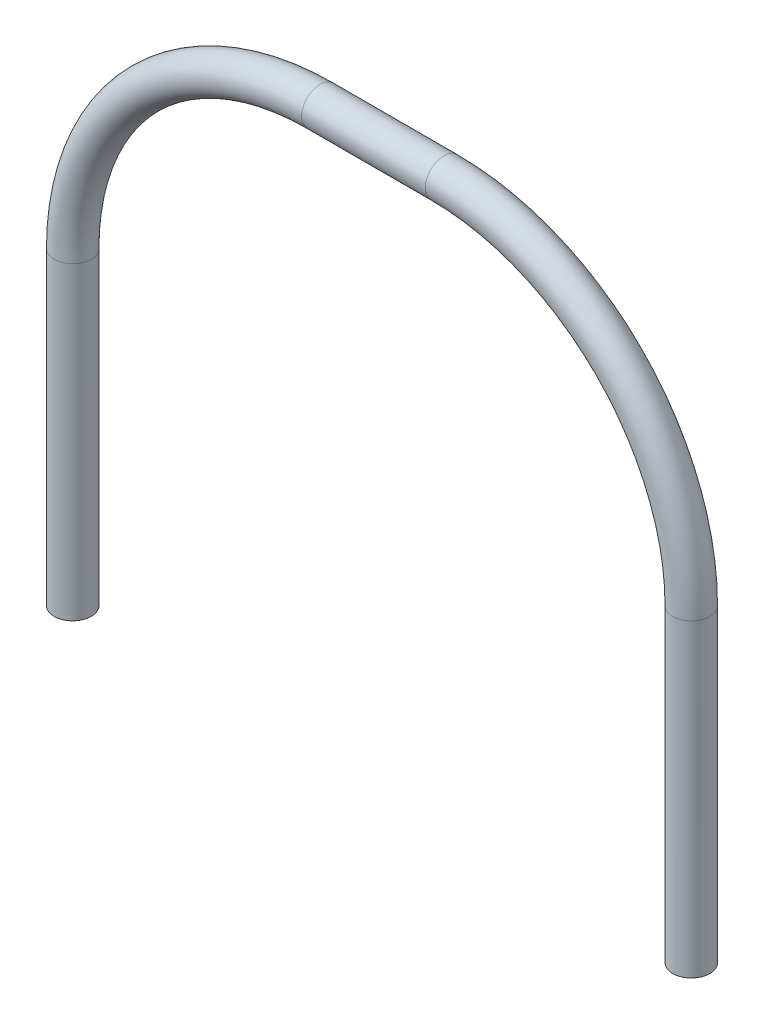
ISO-10303-21;
HEADER;
FILE_DESCRIPTION(('STEP AP214'),'2;1');
FILE_NAME('part.step','',(''),(''),'','','');
FILE_SCHEMA(('AUTOMOTIVE_DESIGN { 1 0 10303 214 1 1 1 1 }'));
ENDSEC;
DATA;
#1=APPLICATION_CONTEXT('core data for automotive mechanical design processes');
#2=APPLICATION_PROTOCOL_DEFINITION('international standard','automotive_design',2000,#1);
#3=PRODUCT_CONTEXT('',#1,'mechanical');
#4=PRODUCT('Part','Part','',(#3));
#5=PRODUCT_RELATED_PRODUCT_CATEGORY('part','',(#4));
#6=PRODUCT_DEFINITION_FORMATION('','',#4);
#7=PRODUCT_DEFINITION_CONTEXT('part definition',#1,'design');
#8=PRODUCT_DEFINITION('design','',#6,#7);
#9=PRODUCT_DEFINITION_SHAPE('','',#8);
#10=(LENGTH_UNIT() NAMED_UNIT(*) SI_UNIT(.MILLI.,.METRE.));
#11=(NAMED_UNIT(*) PLANE_ANGLE_UNIT() SI_UNIT($,.RADIAN.));
#12=(NAMED_UNIT(*) SI_UNIT($,.STERADIAN.) SOLID_ANGLE_UNIT());
#13=UNCERTAINTY_MEASURE_WITH_UNIT(LENGTH_MEASURE(1.E-05),#10,'distance_accuracy_value','');
#14=(GEOMETRIC_REPRESENTATION_CONTEXT(3) GLOBAL_UNCERTAINTY_ASSIGNED_CONTEXT((#13)) GLOBAL_UNIT_ASSIGNED_CONTEXT((#10,
#11,#12)) REPRESENTATION_CONTEXT('',''));
#15=CARTESIAN_POINT('',(0.,0.,0.));
#16=DIRECTION('',(0.,0.,1.));
#17=DIRECTION('',(1.,0.,0.));
#18=AXIS2_PLACEMENT_3D('',#15,#16,#17);
#19=CARTESIAN_POINT('',(5.,2.49999999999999,0.));
#20=DIRECTION('',(0.,-1.,0.));
#21=DIRECTION('',(0.,0.,-1.));
#22=AXIS2_PLACEMENT_3D('',#19,#20,#21);
#23=CYLINDRICAL_SURFACE('',#22,0.149999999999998);
#24=CARTESIAN_POINT('',(5.,2.49999999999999,0.));
#25=DIRECTION('',(0.,-1.,0.));
#26=DIRECTION('',(0.,0.,1.));
#27=AXIS2_PLACEMENT_3D('',#24,#25,#26);
#28=CIRCLE('',#27,0.149999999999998);
#29=CARTESIAN_POINT('',(5.15,2.49999999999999,0.));
#30=VERTEX_POINT('',#29);
#31=EDGE_CURVE('E30',#30,#30,#28,.T.);
#32=ORIENTED_EDGE('',*,*,#31,.T.);
#33=EDGE_LOOP('',(#32));
#34=FACE_BOUND('',#33,.T.);
#35=CARTESIAN_POINT('',(5.,0.,0.));
#36=DIRECTION('',(0.,-1.,0.));
#37=DIRECTION('',(0.,0.,1.));
#38=AXIS2_PLACEMENT_3D('',#35,#36,#37);
#39=CIRCLE('',#38,0.149999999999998);
#40=CARTESIAN_POINT('',(5.,0.,0.149999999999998));
#41=VERTEX_POINT('',#40);
#42=EDGE_CURVE('E10',#41,#41,#39,.T.);
#43=ORIENTED_EDGE('',*,*,#42,.F.);
#44=EDGE_LOOP('',(#43));
#45=FACE_BOUND('',#44,.T.);
#46=ADVANCED_FACE('F24',(#34,#45),#23,.T.);
#47=CARTESIAN_POINT('',(3.,2.5,0.));
#48=DIRECTION('',(0.,0.,-1.));
#49=DIRECTION('',(-1.,0.,0.));
#50=AXIS2_PLACEMENT_3D('',#47,#48,#49);
#51=TOROIDAL_SURFACE('',#50,2.,0.149999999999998);
#52=CARTESIAN_POINT('',(2.99999999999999,4.5,0.));
#53=DIRECTION('',(1.,0.,0.));
#54=DIRECTION('',(0.,0.,1.));
#55=AXIS2_PLACEMENT_3D('',#52,#53,#54);
#56=CIRCLE('',#55,0.149999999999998);
#57=CARTESIAN_POINT('',(2.99999999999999,4.65,0.));
#58=VERTEX_POINT('',#57);
#59=EDGE_CURVE('E34',#58,#58,#56,.T.);
#60=CARTESIAN_POINT('',(3.,2.5,0.));
#61=DIRECTION('',(0.,0.,-1.));
#62=DIRECTION('',(-1.,0.,0.));
#63=AXIS2_PLACEMENT_3D('',#60,#61,#62);
#64=CIRCLE('',#63,2.15);
#65=EDGE_CURVE('',#58,#30,#64,.T.);
#66=ORIENTED_EDGE('',*,*,#59,.T.);
#67=ORIENTED_EDGE('',*,*,#31,.F.);
#68=ORIENTED_EDGE('',*,*,#65,.T.);
#69=ORIENTED_EDGE('',*,*,#65,.F.);
#70=EDGE_LOOP('',(#66,#68,#67,#69));
#71=FACE_BOUND('',#70,.T.);
#72=ADVANCED_FACE('F61',(#71),#51,.T.);
#73=CARTESIAN_POINT('',(2.00000000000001,4.5,0.));
#74=DIRECTION('',(1.,0.,0.));
#75=DIRECTION('',(0.,0.,-1.));
#76=AXIS2_PLACEMENT_3D('',#73,#74,#75);
#77=CYLINDRICAL_SURFACE('',#76,0.149999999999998);
#78=CARTESIAN_POINT('',(2.00000000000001,4.5,0.));
#79=DIRECTION('',(1.,0.,0.));
#80=DIRECTION('',(0.,0.,1.));
#81=AXIS2_PLACEMENT_3D('',#78,#79,#80);
#82=CIRCLE('',#81,0.149999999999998);
#83=CARTESIAN_POINT('',(2.00000000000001,4.65,0.));
#84=VERTEX_POINT('',#83);
#85=EDGE_CURVE('E38',#84,#84,#82,.T.);
#86=ORIENTED_EDGE('',*,*,#85,.T.);
#87=EDGE_LOOP('',(#86));
#88=FACE_BOUND('',#87,.T.);
#89=ORIENTED_EDGE('',*,*,#59,.F.);
#90=EDGE_LOOP('',(#89));
#91=FACE_BOUND('',#90,.T.);
#92=ADVANCED_FACE('F65',(#88,#91),#77,.T.);
#93=CARTESIAN_POINT('',(2.,2.5,0.));
#94=DIRECTION('',(0.,0.,-1.));
#95=DIRECTION('',(-1.,0.,0.));
#96=AXIS2_PLACEMENT_3D('',#93,#94,#95);
#97=TOROIDAL_SURFACE('',#96,2.,0.149999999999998);
#98=CARTESIAN_POINT('',(0.,2.49999999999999,0.));
#99=DIRECTION('',(0.,1.,0.));
#100=DIRECTION('',(0.,0.,1.));
#101=AXIS2_PLACEMENT_3D('',#98,#99,#100);
#102=CIRCLE('',#101,0.149999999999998);
#103=CARTESIAN_POINT('',(-0.149999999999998,2.49999999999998,0.));
#104=VERTEX_POINT('',#103);
#105=EDGE_CURVE('E43',#104,#104,#102,.T.);
#106=CARTESIAN_POINT('',(2.,2.5,0.));
#107=DIRECTION('',(0.,0.,-1.));
#108=DIRECTION('',(-1.,0.,0.));
#109=AXIS2_PLACEMENT_3D('',#106,#107,#108);
#110=CIRCLE('',#109,2.15);
#111=EDGE_CURVE('',#104,#84,#110,.T.);
#112=ORIENTED_EDGE('',*,*,#105,.T.);
#113=ORIENTED_EDGE('',*,*,#85,.F.);
#114=ORIENTED_EDGE('',*,*,#111,.T.);
#115=ORIENTED_EDGE('',*,*,#111,.F.);
#116=EDGE_LOOP('',(#112,#114,#113,#115));
#117=FACE_BOUND('',#116,.T.);
#118=ADVANCED_FACE('F71',(#117),#97,.T.);
#119=CARTESIAN_POINT('',(0.,2.49999999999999,0.));
#120=DIRECTION('',(0.,-1.,0.));
#121=DIRECTION('',(0.,0.,-1.));
#122=AXIS2_PLACEMENT_3D('',#119,#120,#121);
#123=CYLINDRICAL_SURFACE('',#122,0.149999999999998);
#124=ORIENTED_EDGE('',*,*,#105,.F.);
#125=EDGE_LOOP('',(#124));
#126=FACE_BOUND('',#125,.T.);
#127=CARTESIAN_POINT('',(0.,0.,0.));
#128=DIRECTION('',(0.,1.,0.));
#129=DIRECTION('',(0.,0.,1.));
#130=AXIS2_PLACEMENT_3D('',#127,#128,#129);
#131=CIRCLE('',#130,0.149999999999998);
#132=CARTESIAN_POINT('',(0.,0.,0.149999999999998));
#133=VERTEX_POINT('',#132);
#134=EDGE_CURVE('E46',#133,#133,#131,.T.);
#135=ORIENTED_EDGE('',*,*,#134,.T.);
#136=EDGE_LOOP('',(#135));
#137=FACE_BOUND('',#136,.T.);
#138=ADVANCED_FACE('F50',(#126,#137),#123,.T.);
#139=CARTESIAN_POINT('',(5.,0.,0.));
#140=DIRECTION('',(0.,-1.,0.));
#141=DIRECTION('',(0.,0.,1.));
#142=AXIS2_PLACEMENT_3D('',#139,#140,#141);
#143=PLANE('',#142);
#144=ORIENTED_EDGE('',*,*,#42,.T.);
#145=EDGE_LOOP('',(#144));
#146=FACE_BOUND('',#145,.T.);
#147=ADVANCED_FACE('F54',(#146),#143,.T.);
#148=CARTESIAN_POINT('',(0.,0.,0.));
#149=DIRECTION('',(0.,1.,0.));
#150=DIRECTION('',(0.,0.,1.));
#151=AXIS2_PLACEMENT_3D('',#148,#149,#150);
#152=PLANE('',#151);
#153=ORIENTED_EDGE('',*,*,#134,.F.);
#154=EDGE_LOOP('',(#153));
#155=FACE_BOUND('',#154,.T.);
#156=ADVANCED_FACE('F52',(#155),#152,.F.);
#157=CLOSED_SHELL('',(#46,#72,#92,#118,#138,#147,#156));
#158=MANIFOLD_SOLID_BREP('B2',#157);
#159=ADVANCED_BREP_SHAPE_REPRESENTATION('',(#18,#158),#14);
#160=SHAPE_DEFINITION_REPRESENTATION(#9,#159);
ENDSEC;
END-ISO-10303-21;
